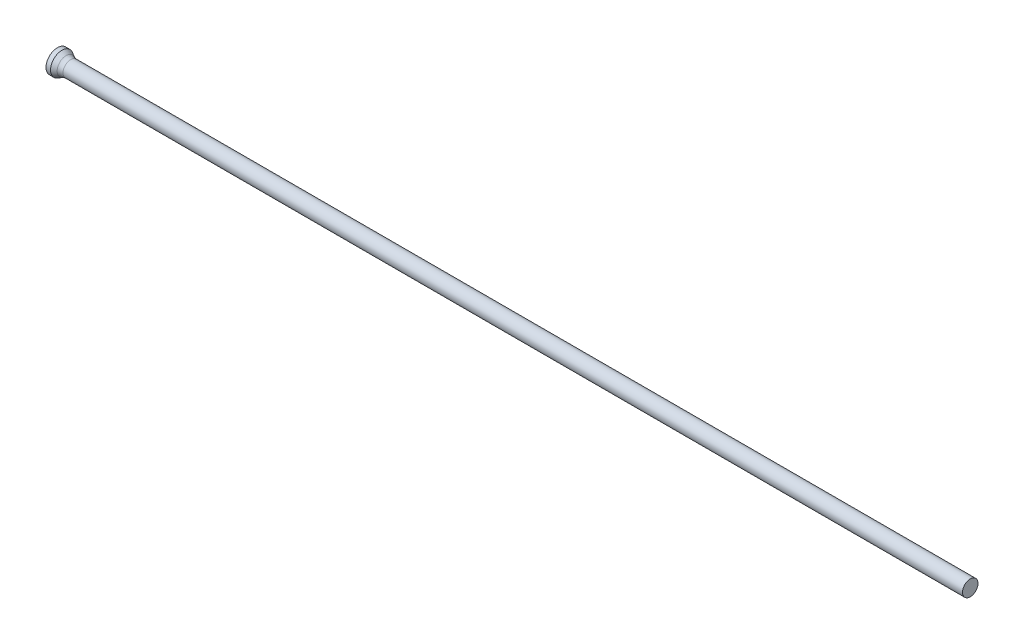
ISO-10303-21;
HEADER;
FILE_DESCRIPTION(('STEP AP214'),'2;1');
FILE_NAME('part.step','',(''),(''),'','','');
FILE_SCHEMA(('AUTOMOTIVE_DESIGN { 1 0 10303 214 1 1 1 1 }'));
ENDSEC;
DATA;
#1=APPLICATION_CONTEXT('core data for automotive mechanical design processes');
#2=APPLICATION_PROTOCOL_DEFINITION('international standard','automotive_design',2000,#1);
#3=PRODUCT_CONTEXT('',#1,'mechanical');
#4=PRODUCT('Part','Part','',(#3));
#5=PRODUCT_RELATED_PRODUCT_CATEGORY('part','',(#4));
#6=PRODUCT_DEFINITION_FORMATION('','',#4);
#7=PRODUCT_DEFINITION_CONTEXT('part definition',#1,'design');
#8=PRODUCT_DEFINITION('design','',#6,#7);
#9=PRODUCT_DEFINITION_SHAPE('','',#8);
#10=(LENGTH_UNIT() NAMED_UNIT(*) SI_UNIT(.MILLI.,.METRE.));
#11=(NAMED_UNIT(*) PLANE_ANGLE_UNIT() SI_UNIT($,.RADIAN.));
#12=(NAMED_UNIT(*) SI_UNIT($,.STERADIAN.) SOLID_ANGLE_UNIT());
#13=UNCERTAINTY_MEASURE_WITH_UNIT(LENGTH_MEASURE(1.E-05),#10,'distance_accuracy_value','');
#14=(GEOMETRIC_REPRESENTATION_CONTEXT(3) GLOBAL_UNCERTAINTY_ASSIGNED_CONTEXT((#13)) GLOBAL_UNIT_ASSIGNED_CONTEXT((#10,
#11,#12)) REPRESENTATION_CONTEXT('',''));
#15=CARTESIAN_POINT('',(0.,0.,0.));
#16=DIRECTION('',(0.,0.,1.));
#17=DIRECTION('',(1.,0.,0.));
#18=AXIS2_PLACEMENT_3D('',#15,#16,#17);
#19=CARTESIAN_POINT('',(0.,0.,0.));
#20=DIRECTION('',(1.,0.,0.));
#21=DIRECTION('',(0.,0.,-1.));
#22=AXIS2_PLACEMENT_3D('',#19,#20,#21);
#23=PLANE('',#22);
#24=CARTESIAN_POINT('',(0.,0.,0.));
#25=DIRECTION('',(-1.,0.,0.));
#26=DIRECTION('',(0.,0.,1.));
#27=AXIS2_PLACEMENT_3D('',#24,#25,#26);
#28=CIRCLE('',#27,1.25);
#29=CARTESIAN_POINT('',(0.,0.,1.25));
#30=VERTEX_POINT('',#29);
#31=EDGE_CURVE('E25',#30,#30,#28,.T.);
#32=ORIENTED_EDGE('',*,*,#31,.T.);
#33=EDGE_LOOP('',(#32));
#34=FACE_BOUND('',#33,.T.);
#35=ADVANCED_FACE('F14',(#34),#23,.F.);
#36=CARTESIAN_POINT('',(0.,0.,0.));
#37=DIRECTION('',(-1.,0.,0.));
#38=DIRECTION('',(0.,0.,1.));
#39=AXIS2_PLACEMENT_3D('',#36,#37,#38);
#40=CYLINDRICAL_SURFACE('',#39,1.25);
#41=ORIENTED_EDGE('',*,*,#31,.F.);
#42=EDGE_LOOP('',(#41));
#43=FACE_BOUND('',#42,.T.);
#44=CARTESIAN_POINT('',(0.497179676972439,0.,0.));
#45=DIRECTION('',(-1.,0.,0.));
#46=DIRECTION('',(0.,0.,1.));
#47=AXIS2_PLACEMENT_3D('',#44,#45,#46);
#48=CIRCLE('',#47,1.25);
#49=CARTESIAN_POINT('',(0.497179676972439,0.,1.25));
#50=VERTEX_POINT('',#49);
#51=EDGE_CURVE('E29',#50,#50,#48,.T.);
#52=ORIENTED_EDGE('',*,*,#51,.T.);
#53=EDGE_LOOP('',(#52));
#54=FACE_BOUND('',#53,.T.);
#55=ADVANCED_FACE('F53',(#43,#54),#40,.T.);
#56=CARTESIAN_POINT('',(1.19,0.,0.));
#57=DIRECTION('',(-1.,0.,0.));
#58=DIRECTION('',(0.,0.,1.));
#59=AXIS2_PLACEMENT_3D('',#56,#57,#58);
#60=CONICAL_SURFACE('',#59,0.85,0.523598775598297);
#61=CARTESIAN_POINT('',(0.957949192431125,0.,0.));
#62=DIRECTION('',(-1.,0.,0.));
#63=DIRECTION('',(0.,0.,1.));
#64=AXIS2_PLACEMENT_3D('',#61,#62,#63);
#65=CIRCLE('',#64,0.983974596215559);
#66=CARTESIAN_POINT('',(0.957949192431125,0.,0.983974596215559));
#67=VERTEX_POINT('',#66);
#68=EDGE_CURVE('E21',#67,#67,#65,.T.);
#69=ORIENTED_EDGE('',*,*,#68,.T.);
#70=EDGE_LOOP('',(#69));
#71=FACE_BOUND('',#70,.T.);
#72=ORIENTED_EDGE('',*,*,#51,.F.);
#73=EDGE_LOOP('',(#72));
#74=FACE_BOUND('',#73,.T.);
#75=ADVANCED_FACE('F50',(#71,#74),#60,.T.);
#76=CARTESIAN_POINT('',(0.,0.,0.));
#77=DIRECTION('',(-1.,0.,0.));
#78=DIRECTION('',(0.,0.,1.));
#79=AXIS2_PLACEMENT_3D('',#76,#77,#78);
#80=CYLINDRICAL_SURFACE('',#79,0.85);
#81=CARTESIAN_POINT('',(1.45794919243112,0.,0.));
#82=DIRECTION('',(-1.,0.,0.));
#83=DIRECTION('',(0.,0.,1.));
#84=AXIS2_PLACEMENT_3D('',#81,#82,#83);
#85=CIRCLE('',#84,0.85);
#86=CARTESIAN_POINT('',(1.45794919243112,0.,0.85));
#87=VERTEX_POINT('',#86);
#88=EDGE_CURVE('E9',#87,#87,#85,.F.);
#89=ORIENTED_EDGE('',*,*,#88,.T.);
#90=EDGE_LOOP('',(#89));
#91=FACE_BOUND('',#90,.T.);
#92=CARTESIAN_POINT('',(100.,0.,0.));
#93=DIRECTION('',(-1.,0.,0.));
#94=DIRECTION('',(0.,0.,1.));
#95=AXIS2_PLACEMENT_3D('',#92,#93,#94);
#96=CIRCLE('',#95,0.85);
#97=CARTESIAN_POINT('',(100.,0.,0.85));
#98=VERTEX_POINT('',#97);
#99=EDGE_CURVE('E34',#98,#98,#96,.T.);
#100=ORIENTED_EDGE('',*,*,#99,.T.);
#101=EDGE_LOOP('',(#100));
#102=FACE_BOUND('',#101,.T.);
#103=ADVANCED_FACE('F38',(#91,#102),#80,.T.);
#104=CARTESIAN_POINT('',(100.,0.85,0.));
#105=DIRECTION('',(-1.,0.,0.));
#106=DIRECTION('',(0.,0.,1.));
#107=AXIS2_PLACEMENT_3D('',#104,#105,#106);
#108=PLANE('',#107);
#109=ORIENTED_EDGE('',*,*,#99,.F.);
#110=EDGE_LOOP('',(#109));
#111=FACE_BOUND('',#110,.T.);
#112=ADVANCED_FACE('F40',(#111),#108,.F.);
#113=CARTESIAN_POINT('',(1.45794919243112,0.,0.));
#114=DIRECTION('',(-1.,0.,0.));
#115=DIRECTION('',(0.,0.,1.));
#116=AXIS2_PLACEMENT_3D('',#113,#114,#115);
#117=TOROIDAL_SURFACE('',#116,1.85,1.);
#118=ORIENTED_EDGE('',*,*,#88,.F.);
#119=EDGE_LOOP('',(#118));
#120=FACE_BOUND('',#119,.T.);
#121=ORIENTED_EDGE('',*,*,#68,.F.);
#122=EDGE_LOOP('',(#121));
#123=FACE_BOUND('',#122,.T.);
#124=ADVANCED_FACE('F16',(#120,#123),#117,.F.);
#125=CLOSED_SHELL('',(#35,#55,#75,#103,#112,#124));
#126=MANIFOLD_SOLID_BREP('B1',#125);
#127=ADVANCED_BREP_SHAPE_REPRESENTATION('',(#18,#126),#14);
#128=SHAPE_DEFINITION_REPRESENTATION(#9,#127);
ENDSEC;
END-ISO-10303-21;
